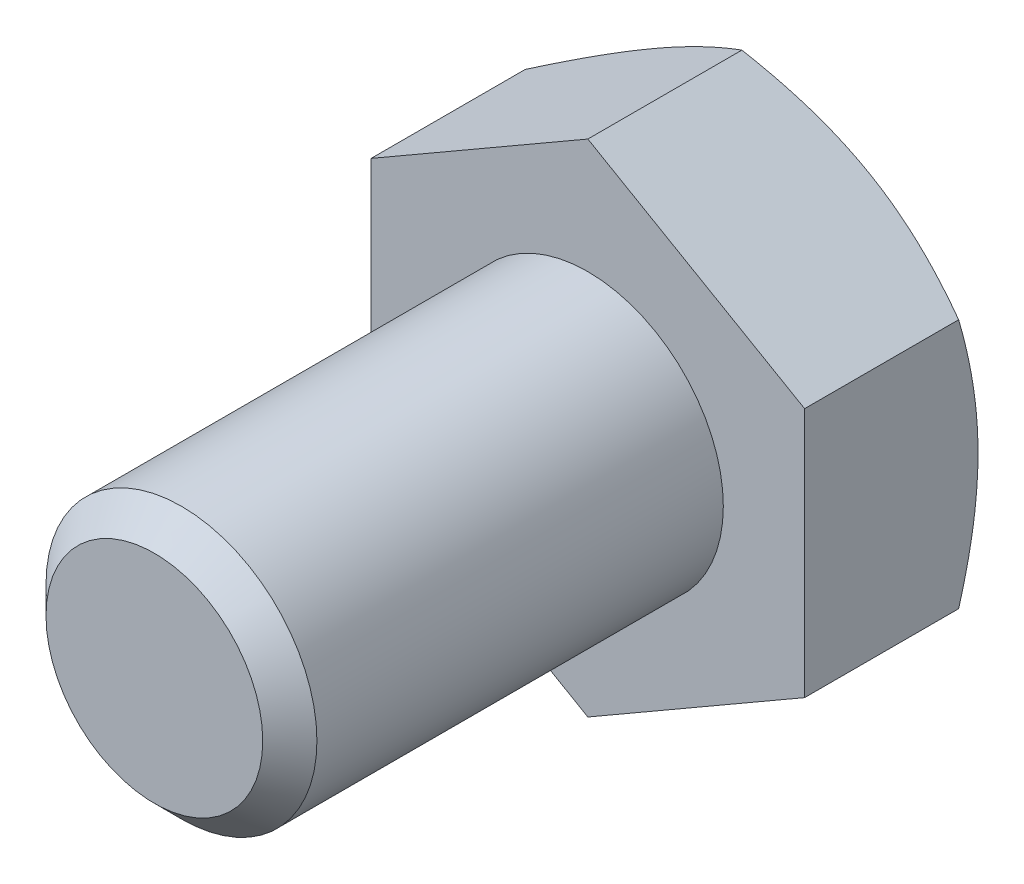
ISO-10303-21;
HEADER;
FILE_DESCRIPTION(('STEP AP214'),'2;1');
FILE_NAME('part.step','',(''),(''),'','','');
FILE_SCHEMA(('AUTOMOTIVE_DESIGN { 1 0 10303 214 1 1 1 1 }'));
ENDSEC;
DATA;
#1=APPLICATION_CONTEXT('core data for automotive mechanical design processes');
#2=APPLICATION_PROTOCOL_DEFINITION('international standard','automotive_design',2000,#1);
#3=PRODUCT_CONTEXT('',#1,'mechanical');
#4=PRODUCT('Part','Part','',(#3));
#5=PRODUCT_RELATED_PRODUCT_CATEGORY('part','',(#4));
#6=PRODUCT_DEFINITION_FORMATION('','',#4);
#7=PRODUCT_DEFINITION_CONTEXT('part definition',#1,'design');
#8=PRODUCT_DEFINITION('design','',#6,#7);
#9=PRODUCT_DEFINITION_SHAPE('','',#8);
#10=(LENGTH_UNIT() NAMED_UNIT(*) SI_UNIT(.MILLI.,.METRE.));
#11=(NAMED_UNIT(*) PLANE_ANGLE_UNIT() SI_UNIT($,.RADIAN.));
#12=(NAMED_UNIT(*) SI_UNIT($,.STERADIAN.) SOLID_ANGLE_UNIT());
#13=UNCERTAINTY_MEASURE_WITH_UNIT(LENGTH_MEASURE(1.E-05),#10,'distance_accuracy_value','');
#14=(GEOMETRIC_REPRESENTATION_CONTEXT(3) GLOBAL_UNCERTAINTY_ASSIGNED_CONTEXT((#13)) GLOBAL_UNIT_ASSIGNED_CONTEXT((#10,
#11,#12)) REPRESENTATION_CONTEXT('',''));
#15=CARTESIAN_POINT('',(0.,0.,0.));
#16=DIRECTION('',(0.,0.,1.));
#17=DIRECTION('',(1.,0.,0.));
#18=AXIS2_PLACEMENT_3D('',#15,#16,#17);
#19=CARTESIAN_POINT('',(0.,0.,16.));
#20=DIRECTION('',(0.,0.,1.));
#21=DIRECTION('',(1.00000000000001,0.,0.));
#22=AXIS2_PLACEMENT_3D('',#19,#20,#21);
#23=PLANE('',#22);
#24=CARTESIAN_POINT('',(0.,0.,16.));
#25=DIRECTION('',(0.,0.,1.));
#26=DIRECTION('',(1.00000000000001,0.,0.));
#27=AXIS2_PLACEMENT_3D('',#24,#25,#26);
#28=CIRCLE('',#27,4.);
#29=CARTESIAN_POINT('',(4.00000000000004,0.,16.));
#30=VERTEX_POINT('',#29);
#31=EDGE_CURVE('E213',#30,#30,#28,.T.);
#32=ORIENTED_EDGE('',*,*,#31,.T.);
#33=EDGE_LOOP('',(#32));
#34=FACE_BOUND('',#33,.T.);
#35=ADVANCED_FACE('F39',(#34),#23,.T.);
#36=CARTESIAN_POINT('',(0.,0.,0.));
#37=DIRECTION('',(0.,0.,1.));
#38=DIRECTION('',(1.00000000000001,0.,0.));
#39=AXIS2_PLACEMENT_3D('',#36,#37,#38);
#40=CYLINDRICAL_SURFACE('',#39,5.);
#41=CARTESIAN_POINT('',(0.,0.,15.));
#42=DIRECTION('',(0.,0.,1.));
#43=DIRECTION('',(1.00000000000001,0.,0.));
#44=AXIS2_PLACEMENT_3D('',#41,#42,#43);
#45=CIRCLE('',#44,5.);
#46=CARTESIAN_POINT('',(5.00000000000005,0.,15.));
#47=VERTEX_POINT('',#46);
#48=EDGE_CURVE('E215',#47,#47,#45,.F.);
#49=ORIENTED_EDGE('',*,*,#48,.T.);
#50=EDGE_LOOP('',(#49));
#51=FACE_BOUND('',#50,.T.);
#52=CARTESIAN_POINT('',(0.,0.,0.));
#53=DIRECTION('',(0.,0.,1.));
#54=DIRECTION('',(1.00000000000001,0.,0.));
#55=AXIS2_PLACEMENT_3D('',#52,#53,#54);
#56=CIRCLE('',#55,5.);
#57=CARTESIAN_POINT('',(5.00000000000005,0.,0.));
#58=VERTEX_POINT('',#57);
#59=EDGE_CURVE('E216',#58,#58,#56,.F.);
#60=ORIENTED_EDGE('',*,*,#59,.F.);
#61=EDGE_LOOP('',(#60));
#62=FACE_BOUND('',#61,.T.);
#63=ADVANCED_FACE('F204',(#51,#62),#40,.T.);
#64=CARTESIAN_POINT('',(0.,0.,16.));
#65=DIRECTION('',(0.,0.,-1.));
#66=DIRECTION('',(-1.00000000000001,0.,0.));
#67=AXIS2_PLACEMENT_3D('',#64,#65,#66);
#68=CONICAL_SURFACE('',#67,4.,0.785398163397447);
#69=ORIENTED_EDGE('',*,*,#48,.F.);
#70=EDGE_LOOP('',(#69));
#71=FACE_BOUND('',#70,.T.);
#72=ORIENTED_EDGE('',*,*,#31,.F.);
#73=EDGE_LOOP('',(#72));
#74=FACE_BOUND('',#73,.T.);
#75=ADVANCED_FACE('F209',(#71,#74),#68,.T.);
#76=CARTESIAN_POINT('',(-6.66133814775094E-13,9.2376043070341,-6.4));
#77=DIRECTION('',(0.500000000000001,0.866025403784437,0.));
#78=DIRECTION('',(-0.866025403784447,0.499999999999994,0.));
#79=AXIS2_PLACEMENT_3D('',#76,#77,#78);
#80=PLANE('',#79);
#81=CARTESIAN_POINT('',(-0.000200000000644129,9.23771977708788,-5.68540215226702));
#82=CARTESIAN_POINT('',(0.175648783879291,9.13619343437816,-5.74400928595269));
#83=CARTESIAN_POINT('',(0.352153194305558,9.03428856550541,-5.7999565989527));
#84=CARTESIAN_POINT('',(0.706595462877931,8.82965122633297,-5.90579899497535));
#85=CARTESIAN_POINT('',(0.884533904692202,8.72691841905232,-5.95569146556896));
#86=CARTESIAN_POINT('',(1.42119823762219,8.41707512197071,-6.0953072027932));
#87=CARTESIAN_POINT('',(1.7820425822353,8.20874154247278,-6.17471882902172));
#88=CARTESIAN_POINT('',(2.32203917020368,7.89697436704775,-6.26783835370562));
#89=CARTESIAN_POINT('',(2.49957818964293,7.79447216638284,-6.294365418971));
#90=CARTESIAN_POINT('',(2.85545911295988,7.58900421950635,-6.33884682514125));
#91=CARTESIAN_POINT('',(3.03380094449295,7.48603851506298,-6.35680192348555));
#92=CARTESIAN_POINT('',(3.39079168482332,7.27992981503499,-6.38368435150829));
#93=CARTESIAN_POINT('',(3.56944001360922,7.17678715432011,-6.39262192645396));
#94=CARTESIAN_POINT('',(3.92690170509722,6.97040655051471,-6.40127769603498));
#95=CARTESIAN_POINT('',(4.10571506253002,6.86716861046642,-6.40099617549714));
#96=CARTESIAN_POINT('',(4.44001336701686,6.67416139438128,-6.39185497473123));
#97=CARTESIAN_POINT('',(4.59552190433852,6.58437849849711,-6.38411039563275));
#98=CARTESIAN_POINT('',(4.90617476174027,6.40502298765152,-6.36179886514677));
#99=CARTESIAN_POINT('',(5.06131905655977,6.31545038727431,-6.34723145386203));
#100=CARTESIAN_POINT('',(5.52615131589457,6.04707935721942,-6.2936393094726));
#101=CARTESIAN_POINT('',(5.83501648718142,5.86875596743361,-6.24473135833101));
#102=CARTESIAN_POINT('',(6.45602322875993,5.51021755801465,-6.12246059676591));
#103=CARTESIAN_POINT('',(6.76808554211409,5.3300482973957,-6.04857947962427));
#104=CARTESIAN_POINT('',(7.3875564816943,4.97239658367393,-5.8808998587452));
#105=CARTESIAN_POINT('',(7.69497304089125,4.79490955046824,-5.78714073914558));
#106=CARTESIAN_POINT('',(8.0001999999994,4.61868668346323,-5.68540215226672));
#107=B_SPLINE_CURVE_WITH_KNOTS('',3,(#81,#82,#83,#84,#85,#86,#87,#88,#89,#90,#91,#92,#93,#94,
#95,#96,#97,#98,#99,#100,#101,#102,#103,#104,#105,#106),.UNSPECIFIED.,.F.,.F.,(4,2,2,2,2,2,2,2,
2,2,2,2,4),(0.,0.633973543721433,1.26821965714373,2.53934712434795,3.15934343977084,
3.77928496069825,4.39852133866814,5.01773858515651,5.556802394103,6.09590254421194,
7.1748707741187,8.27776850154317,9.37850115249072),.UNSPECIFIED.);
#108=CARTESIAN_POINT('',(-6.66133814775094E-13,9.2376043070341,-5.68546882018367));
#109=VERTEX_POINT('',#108);
#110=CARTESIAN_POINT('',(3.99999999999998,6.92820323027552,-6.4));
#111=VERTEX_POINT('',#110);
#112=EDGE_CURVE('E249',#109,#111,#107,.T.);
#113=ORIENTED_EDGE('',*,*,#112,.F.);
#114=DIRECTION('',(0.,0.,1.));
#115=VECTOR('',#114,1.);
#116=CARTESIAN_POINT('',(-6.66133814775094E-13,9.2376043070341,-6.4));
#117=LINE('',#116,#115);
#118=CARTESIAN_POINT('',(-6.66133814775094E-13,9.2376043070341,0.));
#119=VERTEX_POINT('',#118);
#120=EDGE_CURVE('E223',#109,#119,#117,.T.);
#121=ORIENTED_EDGE('',*,*,#120,.T.);
#122=DIRECTION('',(-0.866025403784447,0.499999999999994,0.));
#123=VECTOR('',#122,1.);
#124=CARTESIAN_POINT('',(-6.66133814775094E-13,9.2376043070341,0.));
#125=LINE('',#124,#123);
#126=CARTESIAN_POINT('',(8.00000000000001,4.61880215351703,3.05311331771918E-13));
#127=VERTEX_POINT('',#126);
#128=EDGE_CURVE('E247',#127,#119,#125,.T.);
#129=ORIENTED_EDGE('',*,*,#128,.F.);
#130=DIRECTION('',(0.,0.,1.));
#131=VECTOR('',#130,1.);
#132=CARTESIAN_POINT('',(8.00000000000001,4.61880215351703,-6.3999999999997));
#133=LINE('',#132,#131);
#134=CARTESIAN_POINT('',(8.00000000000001,4.61880215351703,-5.68546882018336));
#135=VERTEX_POINT('',#134);
#136=EDGE_CURVE('E220',#135,#127,#133,.T.);
#137=ORIENTED_EDGE('',*,*,#136,.F.);
#138=EDGE_CURVE('E179',#111,#135,#107,.T.);
#139=ORIENTED_EDGE('',*,*,#138,.F.);
#140=EDGE_LOOP('',(#113,#121,#129,#137,#139));
#141=FACE_BOUND('',#140,.T.);
#142=ADVANCED_FACE('F189',(#141),#80,.T.);
#143=CARTESIAN_POINT('',(7.9999999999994,-4.61880215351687,-6.3999999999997));
#144=DIRECTION('',(1.00000000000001,0.,0.));
#145=DIRECTION('',(0.,0.,-1.));
#146=AXIS2_PLACEMENT_3D('',#143,#144,#145);
#147=PLANE('',#146);
#148=CARTESIAN_POINT('',(8.00000000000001,-12.5978512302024,-2.40281206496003));
#149=CARTESIAN_POINT('',(7.99999999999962,-12.2467461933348,-2.57388946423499));
#150=CARTESIAN_POINT('',(7.99999999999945,-11.8948553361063,-2.74338074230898));
#151=CARTESIAN_POINT('',(7.99999999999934,-11.189084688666,-3.07830251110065));
#152=CARTESIAN_POINT('',(7.99999999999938,-10.8352046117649,-3.24373239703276));
#153=CARTESIAN_POINT('',(7.99999999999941,-10.1233054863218,-3.57043443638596));
#154=CARTESIAN_POINT('',(7.9999999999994,-9.76527449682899,-3.73168065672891));
#155=CARTESIAN_POINT('',(7.99999999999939,-9.04643054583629,-4.04782365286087));
#156=CARTESIAN_POINT('',(7.9999999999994,-8.68561771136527,-4.20272071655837));
#157=CARTESIAN_POINT('',(7.9999999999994,-7.94836823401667,-4.50960168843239));
#158=CARTESIAN_POINT('',(7.99999999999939,-7.57181608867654,-4.66130959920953));
#159=CARTESIAN_POINT('',(7.99999999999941,-6.81437869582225,-4.95369969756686));
#160=CARTESIAN_POINT('',(7.99999999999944,-6.43349297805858,-5.09438067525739));
#161=CARTESIAN_POINT('',(7.99999999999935,-5.66743059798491,-5.36116349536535));
#162=CARTESIAN_POINT('',(7.99999999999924,-5.28226375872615,-5.48729325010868));
#163=CARTESIAN_POINT('',(7.99999999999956,-4.50642197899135,-5.72105487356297));
#164=CARTESIAN_POINT('',(7.99999999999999,-4.11574875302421,-5.8286923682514));
#165=CARTESIAN_POINT('',(7.99999999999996,-3.33076858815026,-6.0198555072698));
#166=CARTESIAN_POINT('',(7.9999999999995,-2.93649538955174,-6.1035160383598));
#167=CARTESIAN_POINT('',(7.99999999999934,-2.34134760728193,-6.2074925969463));
#168=CARTESIAN_POINT('',(7.99999999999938,-2.14232908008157,-6.23856705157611));
#169=CARTESIAN_POINT('',(7.99999999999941,-1.74323916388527,-6.29294025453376));
#170=CARTESIAN_POINT('',(7.9999999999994,-1.54316787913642,-6.31623975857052));
#171=CARTESIAN_POINT('',(7.99999999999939,-1.14493807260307,-6.35429623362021));
#172=CARTESIAN_POINT('',(7.99999999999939,-0.946790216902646,-6.36916434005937));
#173=CARTESIAN_POINT('',(7.99999999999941,-0.550042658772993,-6.39050002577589));
#174=CARTESIAN_POINT('',(7.99999999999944,-0.351442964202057,-6.39696775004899));
#175=CARTESIAN_POINT('',(7.99999999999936,0.0458536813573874,-6.40134753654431));
#176=CARTESIAN_POINT('',(7.99999999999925,0.244550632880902,-6.39925955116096));
#177=CARTESIAN_POINT('',(7.99999999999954,0.641675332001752,-6.38658102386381));
#178=CARTESIAN_POINT('',(7.99999999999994,0.840103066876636,-6.37599009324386));
#179=CARTESIAN_POINT('',(8.00000000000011,1.31123186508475,-6.34097810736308));
#180=CARTESIAN_POINT('',(7.99999999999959,1.58366327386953,-6.31284309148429));
#181=CARTESIAN_POINT('',(7.9999999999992,2.12661564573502,-6.24203710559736));
#182=CARTESIAN_POINT('',(7.99999999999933,2.39713636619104,-6.19936432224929));
#183=CARTESIAN_POINT('',(7.99999999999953,3.20545284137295,-6.05179305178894));
#184=CARTESIAN_POINT('',(7.99999999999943,3.73973646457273,-5.92736416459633));
#185=CARTESIAN_POINT('',(7.99999999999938,4.5390643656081,-5.7101299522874));
#186=CARTESIAN_POINT('',(7.99999999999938,4.80821183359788,-5.63154182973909));
#187=CARTESIAN_POINT('',(7.99999999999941,5.3438959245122,-5.4658417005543));
#188=CARTESIAN_POINT('',(7.99999999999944,5.61043252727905,-5.37872962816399));
#189=CARTESIAN_POINT('',(7.99999999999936,6.14097486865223,-5.19740915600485));
#190=CARTESIAN_POINT('',(7.99999999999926,6.40498129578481,-5.10320275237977));
#191=CARTESIAN_POINT('',(7.99999999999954,6.93077992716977,-4.90883812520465));
#192=CARTESIAN_POINT('',(7.9999999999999,7.19257218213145,-4.80868003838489));
#193=CARTESIAN_POINT('',(8.00000000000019,7.89757234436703,-4.53123135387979));
#194=CARTESIAN_POINT('',(7.99999999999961,8.3389208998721,-4.34922056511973));
#195=CARTESIAN_POINT('',(7.99999999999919,9.21706508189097,-3.9744900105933));
#196=CARTESIAN_POINT('',(7.99999999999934,9.65386019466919,-3.78176905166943));
#197=CARTESIAN_POINT('',(7.99999999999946,10.5239434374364,-3.3881548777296));
#198=CARTESIAN_POINT('',(7.99999999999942,10.9572301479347,-3.18725853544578));
#199=CARTESIAN_POINT('',(7.99999999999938,11.8208356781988,-2.77925077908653));
#200=CARTESIAN_POINT('',(7.9999999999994,12.2511546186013,-2.57213961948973));
#201=CARTESIAN_POINT('',(7.99999999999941,13.1101061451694,-2.15271844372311));
#202=CARTESIAN_POINT('',(7.9999999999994,13.5387348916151,-1.94040058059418));
#203=CARTESIAN_POINT('',(7.9999999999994,14.3940561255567,-1.51189757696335));
#204=CARTESIAN_POINT('',(7.9999999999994,14.8207485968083,-1.29571240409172));
#205=CARTESIAN_POINT('',(7.9999999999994,15.6724483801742,-0.860283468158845));
#206=CARTESIAN_POINT('',(7.9999999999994,16.0974560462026,-0.641040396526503));
#207=CARTESIAN_POINT('',(7.9999999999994,16.9461557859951,-0.200021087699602));
#208=CARTESIAN_POINT('',(7.9999999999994,17.3698478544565,0.0217551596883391));
#209=CARTESIAN_POINT('',(7.9999999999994,18.5495919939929,0.642968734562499));
#210=CARTESIAN_POINT('',(7.9999999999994,19.3044430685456,1.04468640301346));
#211=CARTESIAN_POINT('',(7.9999999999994,20.8116128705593,1.85294502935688));
#212=CARTESIAN_POINT('',(7.9999999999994,21.563931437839,2.2594862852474));
#213=CARTESIAN_POINT('',(7.9999999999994,23.064082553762,3.07479055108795));
#214=CARTESIAN_POINT('',(7.9999999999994,23.8119216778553,3.48354147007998));
#215=CARTESIAN_POINT('',(7.9999999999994,24.9325210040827,4.09870759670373));
#216=CARTESIAN_POINT('',(7.99999999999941,25.305846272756,4.30409483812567));
#217=CARTESIAN_POINT('',(7.9999999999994,26.0521604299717,4.71547851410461));
#218=CARTESIAN_POINT('',(7.9999999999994,26.4251493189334,4.92147494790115));
#219=CARTESIAN_POINT('',(7.9999999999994,26.7979906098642,5.12773824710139));
#220=B_SPLINE_CURVE_WITH_KNOTS('',3,(#148,#149,#150,#151,#152,#153,#154,#155,#156,#157,#158,
#159,#160,#161,#162,#163,#164,#165,#166,#167,#168,#169,#170,#171,#172,#173,#174,#175,#176,#177,
#178,#179,#180,#181,#182,#183,#184,#185,#186,#187,#188,#189,#190,#191,#192,#193,#194,#195,#196,
#197,#198,#199,#200,#201,#202,#203,#204,#205,#206,#207,#208,#209,#210,#211,#212,#213,#214,#215,
#216,#217,#218,#219),.UNSPECIFIED.,.F.,.F.,(4,2,2,2,2,2,2,2,2,2,2,2,2,2,2,2,2,2,2,2,2,2,2,2,2,2,
2,2,2,2,2,2,2,2,2,4),(0.,1.17171303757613,2.34359951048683,3.52154779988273,4.69944261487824,
5.91720060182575,7.13509201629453,8.35060698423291,9.56575149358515,10.7739194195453,
11.3780811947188,11.982184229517,12.5781274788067,13.174060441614,13.7699967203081,
14.3659602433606,15.1871414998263,16.0084252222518,17.6517912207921,18.4928743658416,
19.3339639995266,20.1748178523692,21.0156523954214,22.44765878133,23.8798250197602,
25.3125443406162,26.745205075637,28.1801767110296,29.6151603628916,31.0498246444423,
32.4844947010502,35.0497345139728,37.6151336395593,40.171894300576,41.4501744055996,
42.7284529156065),.UNSPECIFIED.);
#221=CARTESIAN_POINT('',(8.00000000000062,0.,-6.3999999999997));
#222=VERTEX_POINT('',#221);
#223=EDGE_CURVE('E177',#135,#222,#220,.F.);
#224=ORIENTED_EDGE('',*,*,#223,.F.);
#225=ORIENTED_EDGE('',*,*,#136,.T.);
#226=DIRECTION('',(0.,0.999999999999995,0.));
#227=VECTOR('',#226,1.);
#228=CARTESIAN_POINT('',(7.99999999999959,-4.61880215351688,3.05311331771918E-13));
#229=LINE('',#228,#227);
#230=CARTESIAN_POINT('',(7.99999999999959,-4.61880215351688,3.05311331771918E-13));
#231=VERTEX_POINT('',#230);
#232=EDGE_CURVE('E225',#231,#127,#229,.T.);
#233=ORIENTED_EDGE('',*,*,#232,.F.);
#234=DIRECTION('',(0.,0.,1.));
#235=VECTOR('',#234,1.);
#236=CARTESIAN_POINT('',(7.9999999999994,-4.61880215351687,-6.3999999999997));
#237=LINE('',#236,#235);
#238=CARTESIAN_POINT('',(7.9999999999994,-4.61880215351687,-5.68546882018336));
#239=VERTEX_POINT('',#238);
#240=EDGE_CURVE('E231',#239,#231,#237,.T.);
#241=ORIENTED_EDGE('',*,*,#240,.F.);
#242=EDGE_CURVE('E172',#222,#239,#220,.F.);
#243=ORIENTED_EDGE('',*,*,#242,.F.);
#244=EDGE_LOOP('',(#224,#225,#233,#241,#243));
#245=FACE_BOUND('',#244,.T.);
#246=ADVANCED_FACE('F185',(#245),#147,.T.);
#247=CARTESIAN_POINT('',(-1.02695629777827E-12,-9.23760430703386,-6.4));
#248=DIRECTION('',(0.500000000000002,-0.866025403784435,0.));
#249=DIRECTION('',(0.866025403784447,0.499999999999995,0.));
#250=AXIS2_PLACEMENT_3D('',#247,#248,#249);
#251=PLANE('',#250);
#252=CARTESIAN_POINT('',(8.00019999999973,-4.61868668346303,-5.68540215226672));
#253=CARTESIAN_POINT('',(7.82435121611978,-4.72021302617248,-5.7440092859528));
#254=CARTESIAN_POINT('',(7.6478468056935,-4.82211789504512,-5.79995659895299));
#255=CARTESIAN_POINT('',(7.29340453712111,-5.02675523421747,-5.90579899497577));
#256=CARTESIAN_POINT('',(7.11546609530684,-5.12948804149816,-5.95569146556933));
#257=CARTESIAN_POINT('',(6.57880176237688,-5.4393313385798,-6.09530720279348));
#258=CARTESIAN_POINT('',(6.21795741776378,-5.6476649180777,-6.17471882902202));
#259=CARTESIAN_POINT('',(5.67796082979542,-5.9594320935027,-6.26783835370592));
#260=CARTESIAN_POINT('',(5.50042181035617,-6.06193429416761,-6.29436541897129));
#261=CARTESIAN_POINT('',(5.14454088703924,-6.26740224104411,-6.33884682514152));
#262=CARTESIAN_POINT('',(4.96619905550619,-6.3703679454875,-6.35680192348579));
#263=CARTESIAN_POINT('',(4.60920831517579,-6.57647664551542,-6.38368435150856));
#264=CARTESIAN_POINT('',(4.43055998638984,-6.67961930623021,-6.39262192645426));
#265=CARTESIAN_POINT('',(4.07309829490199,-6.88599991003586,-6.40127769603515));
#266=CARTESIAN_POINT('',(3.89428493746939,-6.98923785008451,-6.40099617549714));
#267=CARTESIAN_POINT('',(3.5599866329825,-7.18224506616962,-6.39185497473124));
#268=CARTESIAN_POINT('',(3.40447809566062,-7.27202796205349,-6.38411039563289));
#269=CARTESIAN_POINT('',(3.09382523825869,-7.45138347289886,-6.361798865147));
#270=CARTESIAN_POINT('',(2.93868094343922,-7.54095607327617,-6.34723145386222));
#271=CARTESIAN_POINT('',(2.47384868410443,-7.80932710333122,-6.2936393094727));
#272=CARTESIAN_POINT('',(2.16498351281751,-7.98765049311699,-6.24473135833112));
#273=CARTESIAN_POINT('',(1.5439767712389,-8.34618890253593,-6.12246059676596));
#274=CARTESIAN_POINT('',(1.23191445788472,-8.5263581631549,-6.04857947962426));
#275=CARTESIAN_POINT('',(0.612443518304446,-8.88400987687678,-5.88089985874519));
#276=CARTESIAN_POINT('',(0.305026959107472,-9.06149691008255,-5.78714073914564));
#277=CARTESIAN_POINT('',(-0.000200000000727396,-9.2377197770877,-5.68540215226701));
#278=B_SPLINE_CURVE_WITH_KNOTS('',3,(#252,#253,#254,#255,#256,#257,#258,#259,#260,#261,#262,
#263,#264,#265,#266,#267,#268,#269,#270,#271,#272,#273,#274,#275,#276,#277),.UNSPECIFIED.,.F.,
.F.,(4,2,2,2,2,2,2,2,2,2,2,2,4),(0.,0.633973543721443,1.26821965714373,2.5393471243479,
3.15934343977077,3.77928496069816,4.39852133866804,5.01773858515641,5.55680239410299,
6.095902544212,7.1748707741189,8.27776850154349,9.37850115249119),.UNSPECIFIED.);
#279=CARTESIAN_POINT('',(3.99999999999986,-6.92820323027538,-6.4));
#280=VERTEX_POINT('',#279);
#281=EDGE_CURVE('E178',#239,#280,#278,.T.);
#282=ORIENTED_EDGE('',*,*,#281,.F.);
#283=ORIENTED_EDGE('',*,*,#240,.T.);
#284=DIRECTION('',(0.866025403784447,0.499999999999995,0.));
#285=VECTOR('',#284,1.);
#286=CARTESIAN_POINT('',(-8.32667268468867E-13,-9.23760430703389,0.));
#287=LINE('',#286,#285);
#288=CARTESIAN_POINT('',(-8.32667268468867E-13,-9.23760430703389,0.));
#289=VERTEX_POINT('',#288);
#290=EDGE_CURVE('E236',#289,#231,#287,.T.);
#291=ORIENTED_EDGE('',*,*,#290,.F.);
#292=DIRECTION('',(0.,0.,1.));
#293=VECTOR('',#292,1.);
#294=CARTESIAN_POINT('',(-1.02695629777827E-12,-9.23760430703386,-6.4));
#295=LINE('',#294,#293);
#296=CARTESIAN_POINT('',(-1.02695629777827E-12,-9.23760430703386,-5.68546882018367));
#297=VERTEX_POINT('',#296);
#298=EDGE_CURVE('E229',#297,#289,#295,.T.);
#299=ORIENTED_EDGE('',*,*,#298,.F.);
#300=EDGE_CURVE('E166',#280,#297,#278,.T.);
#301=ORIENTED_EDGE('',*,*,#300,.F.);
#302=EDGE_LOOP('',(#282,#283,#291,#299,#301));
#303=FACE_BOUND('',#302,.T.);
#304=ADVANCED_FACE('F188',(#303),#251,.T.);
#305=CARTESIAN_POINT('',(-1.02695629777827E-12,-9.23760430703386,-6.4));
#306=DIRECTION('',(-0.500000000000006,-0.866025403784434,0.));
#307=DIRECTION('',(0.866025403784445,-0.499999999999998,0.));
#308=AXIS2_PLACEMENT_3D('',#305,#306,#307);
#309=PLANE('',#308);
#310=CARTESIAN_POINT('',(0.000199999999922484,-9.2377197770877,-5.68540215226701));
#311=CARTESIAN_POINT('',(-0.17564878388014,-9.13619343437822,-5.7440092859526));
#312=CARTESIAN_POINT('',(-0.352153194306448,-9.03428856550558,-5.79995659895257));
#313=CARTESIAN_POINT('',(-0.706595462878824,-8.82965122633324,-5.90579899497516));
#314=CARTESIAN_POINT('',(-0.884533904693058,-8.72691841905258,-5.95569146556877));
#315=CARTESIAN_POINT('',(-1.42119823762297,-8.41707512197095,-6.09530720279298));
#316=CARTESIAN_POINT('',(-1.78204258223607,-8.20874154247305,-6.17471882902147));
#317=CARTESIAN_POINT('',(-2.32203917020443,-7.89697436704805,-6.26783835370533));
#318=CARTESIAN_POINT('',(-2.49957818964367,-7.79447216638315,-6.29436541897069));
#319=CARTESIAN_POINT('',(-2.85545911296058,-7.58900421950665,-6.33884682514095));
#320=CARTESIAN_POINT('',(-3.03380094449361,-7.48603851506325,-6.35680192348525));
#321=CARTESIAN_POINT('',(-3.39079168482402,-7.27992981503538,-6.38368435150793));
#322=CARTESIAN_POINT('',(-3.56944001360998,-7.17678715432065,-6.39262192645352));
#323=CARTESIAN_POINT('',(-3.92690170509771,-6.97040655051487,-6.40127769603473));
#324=CARTESIAN_POINT('',(-4.10571506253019,-6.86716861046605,-6.40099617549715));
#325=CARTESIAN_POINT('',(-4.44001336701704,-6.674161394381,-6.3918549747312));
#326=CARTESIAN_POINT('',(-4.59552190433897,-6.58437849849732,-6.38411039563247));
#327=CARTESIAN_POINT('',(-4.90617476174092,-6.40502298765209,-6.36179886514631));
#328=CARTESIAN_POINT('',(-5.06131905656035,-6.31545038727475,-6.34723145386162));
#329=CARTESIAN_POINT('',(-5.52615131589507,-6.04707935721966,-6.29363930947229));
#330=CARTESIAN_POINT('',(-5.83501648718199,-5.86875596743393,-6.24473135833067));
#331=CARTESIAN_POINT('',(-6.45602322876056,-5.51021755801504,-6.12246059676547));
#332=CARTESIAN_POINT('',(-6.76808554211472,-5.3300482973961,-6.04857947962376));
#333=CARTESIAN_POINT('',(-7.38755648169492,-4.97239658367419,-5.8808998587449));
#334=CARTESIAN_POINT('',(-7.69497304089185,-4.79490955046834,-5.78714073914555));
#335=CARTESIAN_POINT('',(-8.00020000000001,-4.61868668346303,-5.68540215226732));
#336=B_SPLINE_CURVE_WITH_KNOTS('',3,(#310,#311,#312,#313,#314,#315,#316,#317,#318,#319,#320,
#321,#322,#323,#324,#325,#326,#327,#328,#329,#330,#331,#332,#333,#334,#335),.UNSPECIFIED.,.F.,
.F.,(4,2,2,2,2,2,2,2,2,2,2,2,4),(0.,0.633973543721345,1.26821965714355,2.53934712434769,
3.15934343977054,3.77928496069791,4.39852133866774,5.01773858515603,5.55680239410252,
6.09590254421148,7.17487077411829,8.27776850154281,9.37850115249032),.UNSPECIFIED.);
#337=CARTESIAN_POINT('',(-3.99999999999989,-6.92820323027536,-6.4));
#338=VERTEX_POINT('',#337);
#339=EDGE_CURVE('E268',#297,#338,#336,.T.);
#340=ORIENTED_EDGE('',*,*,#339,.F.);
#341=ORIENTED_EDGE('',*,*,#298,.T.);
#342=DIRECTION('',(0.866025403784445,-0.499999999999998,0.));
#343=VECTOR('',#342,1.);
#344=CARTESIAN_POINT('',(-8.32667268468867E-13,-9.23760430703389,0.));
#345=LINE('',#344,#343);
#346=CARTESIAN_POINT('',(-8.00000000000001,-4.61880215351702,-3.05311331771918E-13));
#347=VERTEX_POINT('',#346);
#348=EDGE_CURVE('E239',#347,#289,#345,.T.);
#349=ORIENTED_EDGE('',*,*,#348,.F.);
#350=DIRECTION('',(0.,0.,1.));
#351=VECTOR('',#350,1.);
#352=CARTESIAN_POINT('',(-8.00000000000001,-4.6188021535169,-6.40000000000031));
#353=LINE('',#352,#351);
#354=CARTESIAN_POINT('',(-8.00000000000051,-4.61880215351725,-5.68546882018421));
#355=VERTEX_POINT('',#354);
#356=EDGE_CURVE('E227',#355,#347,#353,.T.);
#357=ORIENTED_EDGE('',*,*,#356,.F.);
#358=EDGE_CURVE('E115',#338,#355,#336,.T.);
#359=ORIENTED_EDGE('',*,*,#358,.F.);
#360=EDGE_LOOP('',(#340,#341,#349,#357,#359));
#361=FACE_BOUND('',#360,.T.);
#362=ADVANCED_FACE('F193',(#361),#309,.T.);
#363=CARTESIAN_POINT('',(-8.00000000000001,-4.6188021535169,-6.40000000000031));
#364=DIRECTION('',(-1.00000000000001,0.,0.));
#365=DIRECTION('',(0.,0.,1.));
#366=AXIS2_PLACEMENT_3D('',#363,#364,#365);
#367=PLANE('',#366);
#368=CARTESIAN_POINT('',(-8.00000000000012,-12.5978512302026,-2.40281206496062));
#369=CARTESIAN_POINT('',(-8.00000000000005,-12.2467461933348,-2.57388946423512));
#370=CARTESIAN_POINT('',(-8.00000000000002,-11.8948553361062,-2.74338074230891));
#371=CARTESIAN_POINT('',(-8.,-11.1890846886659,-3.07830251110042));
#372=CARTESIAN_POINT('',(-8.00000000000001,-10.8352046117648,-3.24373239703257));
#373=CARTESIAN_POINT('',(-8.00000000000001,-10.1233054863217,-3.5704344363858));
#374=CARTESIAN_POINT('',(-8.00000000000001,-9.76527449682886,-3.73168065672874));
#375=CARTESIAN_POINT('',(-8.00000000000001,-9.04643054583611,-4.04782365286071));
#376=CARTESIAN_POINT('',(-8.00000000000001,-8.68561771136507,-4.20272071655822));
#377=CARTESIAN_POINT('',(-8.00000000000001,-7.94836823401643,-4.50960168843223));
#378=CARTESIAN_POINT('',(-8.00000000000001,-7.57181608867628,-4.66130959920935));
#379=CARTESIAN_POINT('',(-8.00000000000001,-6.81437869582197,-4.95369969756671));
#380=CARTESIAN_POINT('',(-8.00000000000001,-6.43349297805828,-5.0943806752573));
#381=CARTESIAN_POINT('',(-8.00000000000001,-5.66743059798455,-5.36116349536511));
#382=CARTESIAN_POINT('',(-8.00000000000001,-5.28226375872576,-5.48729325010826));
#383=CARTESIAN_POINT('',(-8.00000000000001,-4.50642197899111,-5.72105487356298));
#384=CARTESIAN_POINT('',(-8.00000000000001,-4.11574875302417,-5.82869236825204));
#385=CARTESIAN_POINT('',(-8.00000000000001,-3.33076858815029,-6.01985550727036));
#386=CARTESIAN_POINT('',(-8.00000000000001,-2.93649538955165,-6.10351603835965));
#387=CARTESIAN_POINT('',(-8.00000000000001,-2.34134760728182,-6.2074925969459));
#388=CARTESIAN_POINT('',(-8.00000000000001,-2.14232908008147,-6.23856705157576));
#389=CARTESIAN_POINT('',(-8.00000000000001,-1.74323916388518,-6.29294025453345));
#390=CARTESIAN_POINT('',(-8.00000000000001,-1.54316787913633,-6.31623975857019));
#391=CARTESIAN_POINT('',(-8.00000000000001,-1.14493807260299,-6.35429623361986));
#392=CARTESIAN_POINT('',(-8.00000000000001,-0.946790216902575,-6.36916434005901));
#393=CARTESIAN_POINT('',(-8.00000000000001,-0.550042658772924,-6.39050002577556));
#394=CARTESIAN_POINT('',(-8.,-0.351442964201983,-6.3969677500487));
#395=CARTESIAN_POINT('',(-8.00000000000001,0.0458536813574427,-6.40134753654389));
#396=CARTESIAN_POINT('',(-8.00000000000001,0.244550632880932,-6.39925955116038));
#397=CARTESIAN_POINT('',(-8.,0.641675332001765,-6.38658102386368));
#398=CARTESIAN_POINT('',(-7.99999999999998,0.840103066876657,-6.37599009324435));
#399=CARTESIAN_POINT('',(-7.99999999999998,1.31123186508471,-6.34097810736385));
#400=CARTESIAN_POINT('',(-8.,1.58366327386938,-6.31284309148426));
#401=CARTESIAN_POINT('',(-8.00000000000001,2.12661564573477,-6.24203710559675));
#402=CARTESIAN_POINT('',(-8.00000000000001,2.3971363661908,-6.19936432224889));
#403=CARTESIAN_POINT('',(-8.,3.20545284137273,-6.05179305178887));
#404=CARTESIAN_POINT('',(-8.00000000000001,3.73973646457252,-5.92736416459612));
#405=CARTESIAN_POINT('',(-8.,4.53906436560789,-5.71012995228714));
#406=CARTESIAN_POINT('',(-8.,4.80821183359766,-5.63154182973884));
#407=CARTESIAN_POINT('',(-8.00000000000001,5.34389592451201,-5.46584170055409));
#408=CARTESIAN_POINT('',(-8.00000000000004,5.61043252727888,-5.37872962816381));
#409=CARTESIAN_POINT('',(-7.99999999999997,6.14097486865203,-5.19740915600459));
#410=CARTESIAN_POINT('',(-7.99999999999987,6.40498129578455,-5.10320275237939));
#411=CARTESIAN_POINT('',(-8.00000000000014,6.93077992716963,-4.90883812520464));
#412=CARTESIAN_POINT('',(-8.00000000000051,7.19257218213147,-4.80868003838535));
#413=CARTESIAN_POINT('',(-8.0000000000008,7.89757234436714,-4.53123135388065));
#414=CARTESIAN_POINT('',(-8.00000000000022,8.33892089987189,-4.34922056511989));
#415=CARTESIAN_POINT('',(-7.99999999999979,9.2170650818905,-3.97449001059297));
#416=CARTESIAN_POINT('',(-7.99999999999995,9.65386019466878,-3.7817690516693));
#417=CARTESIAN_POINT('',(-8.00000000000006,10.5239434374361,-3.38815487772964));
#418=CARTESIAN_POINT('',(-8.00000000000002,10.9572301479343,-3.18725853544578));
#419=CARTESIAN_POINT('',(-7.99999999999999,11.8208356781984,-2.77925077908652));
#420=CARTESIAN_POINT('',(-8.,12.2511546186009,-2.57213961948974));
#421=CARTESIAN_POINT('',(-8.00000000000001,13.110106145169,-2.15271844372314));
#422=CARTESIAN_POINT('',(-8.,13.5387348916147,-1.94040058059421));
#423=CARTESIAN_POINT('',(-8.,14.3940561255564,-1.51189757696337));
#424=CARTESIAN_POINT('',(-8.,14.820748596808,-1.29571240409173));
#425=CARTESIAN_POINT('',(-8.,15.6724483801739,-0.860283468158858));
#426=CARTESIAN_POINT('',(-8.,16.0974560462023,-0.641040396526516));
#427=CARTESIAN_POINT('',(-8.,16.9461557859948,-0.200021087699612));
#428=CARTESIAN_POINT('',(-8.,17.3698478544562,0.0217551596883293));
#429=CARTESIAN_POINT('',(-8.,18.5495919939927,0.642968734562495));
#430=CARTESIAN_POINT('',(-8.,19.3044430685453,1.04468640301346));
#431=CARTESIAN_POINT('',(-8.,20.8116128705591,1.8529450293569));
#432=CARTESIAN_POINT('',(-7.99999999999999,21.5639314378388,2.25948628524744));
#433=CARTESIAN_POINT('',(-8.00000000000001,23.0640825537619,3.07479055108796));
#434=CARTESIAN_POINT('',(-8.00000000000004,23.8119216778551,3.48354147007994));
#435=CARTESIAN_POINT('',(-7.99999999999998,24.9325210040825,4.09870759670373));
#436=CARTESIAN_POINT('',(-7.99999999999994,25.3058462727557,4.30409483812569));
#437=CARTESIAN_POINT('',(-8.00000000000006,26.0521604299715,4.7154785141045));
#438=CARTESIAN_POINT('',(-8.00000000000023,26.4251493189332,4.9214749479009));
#439=CARTESIAN_POINT('',(-8.00000000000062,26.7979906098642,5.12773824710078));
#440=B_SPLINE_CURVE_WITH_KNOTS('',3,(#368,#369,#370,#371,#372,#373,#374,#375,#376,#377,#378,
#379,#380,#381,#382,#383,#384,#385,#386,#387,#388,#389,#390,#391,#392,#393,#394,#395,#396,#397,
#398,#399,#400,#401,#402,#403,#404,#405,#406,#407,#408,#409,#410,#411,#412,#413,#414,#415,#416,
#417,#418,#419,#420,#421,#422,#423,#424,#425,#426,#427,#428,#429,#430,#431,#432,#433,#434,#435,
#436,#437,#438,#439),.UNSPECIFIED.,.F.,.F.,(4,2,2,2,2,2,2,2,2,2,2,2,2,2,2,2,2,2,2,2,2,2,2,2,2,2,
2,2,2,2,2,2,2,2,2,4),(0.,1.17171303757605,2.34359951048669,3.52154779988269,4.69944261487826,
5.9172006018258,7.13509201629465,8.350606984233,9.56575149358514,10.7739194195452,
11.3780811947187,11.9821842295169,12.5781274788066,13.1740604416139,13.7699967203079,
14.3659602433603,15.187141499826,16.0084252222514,17.6517912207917,18.4928743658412,
19.3339639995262,20.1748178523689,21.015652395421,22.4476587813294,23.8798250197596,
25.3125443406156,26.7452050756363,28.180176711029,29.615160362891,31.0498246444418,
32.4844947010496,35.0497345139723,37.6151336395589,40.1718943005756,41.4501744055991,
42.728452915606),.UNSPECIFIED.);
#441=CARTESIAN_POINT('',(-8.00000000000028,1.73472347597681E-13,-6.40000000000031));
#442=VERTEX_POINT('',#441);
#443=EDGE_CURVE('E110',#355,#442,#440,.T.);
#444=ORIENTED_EDGE('',*,*,#443,.F.);
#445=ORIENTED_EDGE('',*,*,#356,.T.);
#446=DIRECTION('',(0.,-0.999999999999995,0.));
#447=VECTOR('',#446,1.);
#448=CARTESIAN_POINT('',(-8.00000000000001,-4.61880215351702,-3.05311331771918E-13));
#449=LINE('',#448,#447);
#450=CARTESIAN_POINT('',(-8.00000000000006,4.61880215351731,-3.05311331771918E-13));
#451=VERTEX_POINT('',#450);
#452=EDGE_CURVE('E242',#451,#347,#449,.T.);
#453=ORIENTED_EDGE('',*,*,#452,.F.);
#454=DIRECTION('',(0.,0.,1.));
#455=VECTOR('',#454,1.);
#456=CARTESIAN_POINT('',(-8.00000000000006,4.61880215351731,-6.40000000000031));
#457=LINE('',#456,#455);
#458=CARTESIAN_POINT('',(-8.00000000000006,4.61880215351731,-5.68546882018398));
#459=VERTEX_POINT('',#458);
#460=EDGE_CURVE('E136',#459,#451,#457,.T.);
#461=ORIENTED_EDGE('',*,*,#460,.F.);
#462=EDGE_CURVE('E119',#442,#459,#440,.T.);
#463=ORIENTED_EDGE('',*,*,#462,.F.);
#464=EDGE_LOOP('',(#444,#445,#453,#461,#463));
#465=FACE_BOUND('',#464,.T.);
#466=ADVANCED_FACE('F134',(#465),#367,.T.);
#467=CARTESIAN_POINT('',(-8.00000000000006,4.61880215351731,-6.40000000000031));
#468=DIRECTION('',(-0.500000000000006,0.866025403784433,0.));
#469=DIRECTION('',(-0.866025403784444,-0.499999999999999,0.));
#470=AXIS2_PLACEMENT_3D('',#467,#468,#469);
#471=PLANE('',#470);
#472=CARTESIAN_POINT('',(-8.00020000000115,4.61868668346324,-5.68540215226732));
#473=CARTESIAN_POINT('',(-7.82435121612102,4.72021302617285,-5.74400928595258));
#474=CARTESIAN_POINT('',(-7.64784680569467,4.82211789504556,-5.79995659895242));
#475=CARTESIAN_POINT('',(-7.29340453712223,5.02675523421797,-5.90579899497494));
#476=CARTESIAN_POINT('',(-7.11546609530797,5.12948804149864,-5.95569146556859));
#477=CARTESIAN_POINT('',(-6.57880176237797,5.43933133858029,-6.09530720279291));
#478=CARTESIAN_POINT('',(-6.2179574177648,5.64766491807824,-6.17471882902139));
#479=CARTESIAN_POINT('',(-5.67796082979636,5.9594320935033,-6.26783835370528));
#480=CARTESIAN_POINT('',(-5.50042181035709,6.06193429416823,-6.29436541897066));
#481=CARTESIAN_POINT('',(-5.1445408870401,6.26740224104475,-6.33884682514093));
#482=CARTESIAN_POINT('',(-4.96619905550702,6.37036794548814,-6.35680192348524));
#483=CARTESIAN_POINT('',(-4.6092083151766,6.57647664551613,-6.38368435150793));
#484=CARTESIAN_POINT('',(-4.43055998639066,6.67961930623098,-6.39262192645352));
#485=CARTESIAN_POINT('',(-4.0730982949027,6.8859999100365,-6.40127769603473));
#486=CARTESIAN_POINT('',(-3.89428493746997,6.98923785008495,-6.40099617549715));
#487=CARTESIAN_POINT('',(-3.55998663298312,7.18224506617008,-6.3918549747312));
#488=CARTESIAN_POINT('',(-3.40447809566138,7.27202796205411,-6.38411039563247));
#489=CARTESIAN_POINT('',(-3.09382523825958,7.4513834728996,-6.36179886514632));
#490=CARTESIAN_POINT('',(-2.93868094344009,7.54095607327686,-6.34723145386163));
#491=CARTESIAN_POINT('',(-2.47384868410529,7.80932710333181,-6.29363930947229));
#492=CARTESIAN_POINT('',(-2.1649835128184,7.9876504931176,-6.24473135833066));
#493=CARTESIAN_POINT('',(-1.54397677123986,8.34618890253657,-6.12246059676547));
#494=CARTESIAN_POINT('',(-1.23191445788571,8.52635816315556,-6.04857947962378));
#495=CARTESIAN_POINT('',(-0.612443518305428,8.88400987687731,-5.88089985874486));
#496=CARTESIAN_POINT('',(-0.305026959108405,9.06149691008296,-5.78714073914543));
#497=CARTESIAN_POINT('',(0.00019999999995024,9.23771977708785,-5.68540215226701));
#498=B_SPLINE_CURVE_WITH_KNOTS('',3,(#472,#473,#474,#475,#476,#477,#478,#479,#480,#481,#482,
#483,#484,#485,#486,#487,#488,#489,#490,#491,#492,#493,#494,#495,#496,#497),.UNSPECIFIED.,.F.,
.F.,(4,2,2,2,2,2,2,2,2,2,2,2,4),(0.,0.633973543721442,1.26821965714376,2.53934712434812,
3.15934343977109,3.77928496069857,4.39852133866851,5.01773858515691,5.55680239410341,
6.09590254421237,7.1748707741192,8.27776850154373,9.37850115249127),.UNSPECIFIED.);
#499=CARTESIAN_POINT('',(-4.00000000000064,6.92820323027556,-6.4));
#500=VERTEX_POINT('',#499);
#501=EDGE_CURVE('E125',#459,#500,#498,.T.);
#502=ORIENTED_EDGE('',*,*,#501,.F.);
#503=ORIENTED_EDGE('',*,*,#460,.T.);
#504=DIRECTION('',(-0.866025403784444,-0.499999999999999,0.));
#505=VECTOR('',#504,1.);
#506=CARTESIAN_POINT('',(-8.00000000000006,4.61880215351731,-3.05311331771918E-13));
#507=LINE('',#506,#505);
#508=EDGE_CURVE('E245',#119,#451,#507,.T.);
#509=ORIENTED_EDGE('',*,*,#508,.F.);
#510=ORIENTED_EDGE('',*,*,#120,.F.);
#511=EDGE_CURVE('E127',#500,#109,#498,.T.);
#512=ORIENTED_EDGE('',*,*,#511,.F.);
#513=EDGE_LOOP('',(#502,#503,#509,#510,#512));
#514=FACE_BOUND('',#513,.T.);
#515=ADVANCED_FACE('F201',(#514),#471,.T.);
#516=CARTESIAN_POINT('',(8.00000000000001,4.61880215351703,3.05311331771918E-13));
#517=DIRECTION('',(0.,0.,1.));
#518=DIRECTION('',(1.00000000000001,0.,0.));
#519=AXIS2_PLACEMENT_3D('',#516,#517,#518);
#520=PLANE('',#519);
#521=ORIENTED_EDGE('',*,*,#59,.T.);
#522=EDGE_LOOP('',(#521));
#523=FACE_BOUND('',#522,.T.);
#524=ORIENTED_EDGE('',*,*,#128,.T.);
#525=ORIENTED_EDGE('',*,*,#508,.T.);
#526=ORIENTED_EDGE('',*,*,#452,.T.);
#527=ORIENTED_EDGE('',*,*,#348,.T.);
#528=ORIENTED_EDGE('',*,*,#290,.T.);
#529=ORIENTED_EDGE('',*,*,#232,.T.);
#530=EDGE_LOOP('',(#524,#525,#526,#527,#528,#529));
#531=FACE_BOUND('',#530,.T.);
#532=ADVANCED_FACE('F158',(#523,#531),#520,.T.);
#533=CARTESIAN_POINT('',(0.,0.,0.));
#534=DIRECTION('',(0.,0.,1.));
#535=DIRECTION('',(1.00000000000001,0.,0.));
#536=AXIS2_PLACEMENT_3D('',#533,#534,#535);
#537=CONICAL_SURFACE('',#536,19.0851251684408,1.0471975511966);
#538=ORIENTED_EDGE('',*,*,#138,.T.);
#539=ORIENTED_EDGE('',*,*,#223,.T.);
#540=CARTESIAN_POINT('',(0.,0.,-6.4));
#541=DIRECTION('',(0.,0.,1.));
#542=DIRECTION('',(1.00000000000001,0.,0.));
#543=AXIS2_PLACEMENT_3D('',#540,#541,#542);
#544=CIRCLE('',#543,8.);
#545=EDGE_CURVE('E42',#111,#222,#544,.F.);
#546=ORIENTED_EDGE('',*,*,#545,.F.);
#547=EDGE_LOOP('',(#538,#539,#546));
#548=FACE_BOUND('',#547,.T.);
#549=ADVANCED_FACE('F258',(#548),#537,.T.);
#550=ORIENTED_EDGE('',*,*,#112,.T.);
#551=EDGE_CURVE('E132',#500,#111,#544,.F.);
#552=ORIENTED_EDGE('',*,*,#551,.F.);
#553=ORIENTED_EDGE('',*,*,#511,.T.);
#554=EDGE_LOOP('',(#550,#552,#553));
#555=FACE_BOUND('',#554,.T.);
#556=ADVANCED_FACE('F157',(#555),#537,.T.);
#557=ORIENTED_EDGE('',*,*,#462,.T.);
#558=ORIENTED_EDGE('',*,*,#501,.T.);
#559=CARTESIAN_POINT('',(0.,0.,-6.4));
#560=DIRECTION('',(0.,0.,-1.));
#561=DIRECTION('',(-1.00000000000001,0.,0.));
#562=AXIS2_PLACEMENT_3D('',#559,#560,#561);
#563=CIRCLE('',#562,8.);
#564=EDGE_CURVE('E60',#442,#500,#563,.T.);
#565=ORIENTED_EDGE('',*,*,#564,.F.);
#566=EDGE_LOOP('',(#557,#558,#565));
#567=FACE_BOUND('',#566,.T.);
#568=ADVANCED_FACE('F123',(#567),#537,.T.);
#569=ORIENTED_EDGE('',*,*,#358,.T.);
#570=ORIENTED_EDGE('',*,*,#443,.T.);
#571=EDGE_CURVE('E112',#338,#442,#544,.F.);
#572=ORIENTED_EDGE('',*,*,#571,.F.);
#573=EDGE_LOOP('',(#569,#570,#572));
#574=FACE_BOUND('',#573,.T.);
#575=ADVANCED_FACE('F111',(#574),#537,.T.);
#576=ORIENTED_EDGE('',*,*,#300,.T.);
#577=ORIENTED_EDGE('',*,*,#339,.T.);
#578=EDGE_CURVE('E47',#280,#338,#544,.F.);
#579=ORIENTED_EDGE('',*,*,#578,.F.);
#580=EDGE_LOOP('',(#576,#577,#579));
#581=FACE_BOUND('',#580,.T.);
#582=ADVANCED_FACE('F270',(#581),#537,.T.);
#583=ORIENTED_EDGE('',*,*,#242,.T.);
#584=ORIENTED_EDGE('',*,*,#281,.T.);
#585=EDGE_CURVE('E13',#222,#280,#544,.F.);
#586=ORIENTED_EDGE('',*,*,#585,.F.);
#587=EDGE_LOOP('',(#583,#584,#586));
#588=FACE_BOUND('',#587,.T.);
#589=ADVANCED_FACE('F265',(#588),#537,.T.);
#590=CARTESIAN_POINT('',(8.00000000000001,4.61880215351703,-6.3999999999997));
#591=DIRECTION('',(0.,0.,1.));
#592=DIRECTION('',(1.00000000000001,0.,0.));
#593=AXIS2_PLACEMENT_3D('',#590,#591,#592);
#594=PLANE('',#593);
#595=ORIENTED_EDGE('',*,*,#545,.T.);
#596=ORIENTED_EDGE('',*,*,#585,.T.);
#597=ORIENTED_EDGE('',*,*,#578,.T.);
#598=ORIENTED_EDGE('',*,*,#571,.T.);
#599=ORIENTED_EDGE('',*,*,#564,.T.);
#600=ORIENTED_EDGE('',*,*,#551,.T.);
#601=EDGE_LOOP('',(#595,#596,#597,#598,#599,#600));
#602=FACE_BOUND('',#601,.T.);
#603=ADVANCED_FACE('F130',(#602),#594,.F.);
#604=CLOSED_SHELL('',(#35,#63,#75,#142,#246,#304,#362,#466,#515,#532,#549,#556,#568,#575,#582,
#589,#603));
#605=MANIFOLD_SOLID_BREP('B2',#604);
#606=ADVANCED_BREP_SHAPE_REPRESENTATION('',(#18,#605),#14);
#607=SHAPE_DEFINITION_REPRESENTATION(#9,#606);
ENDSEC;
END-ISO-10303-21;
